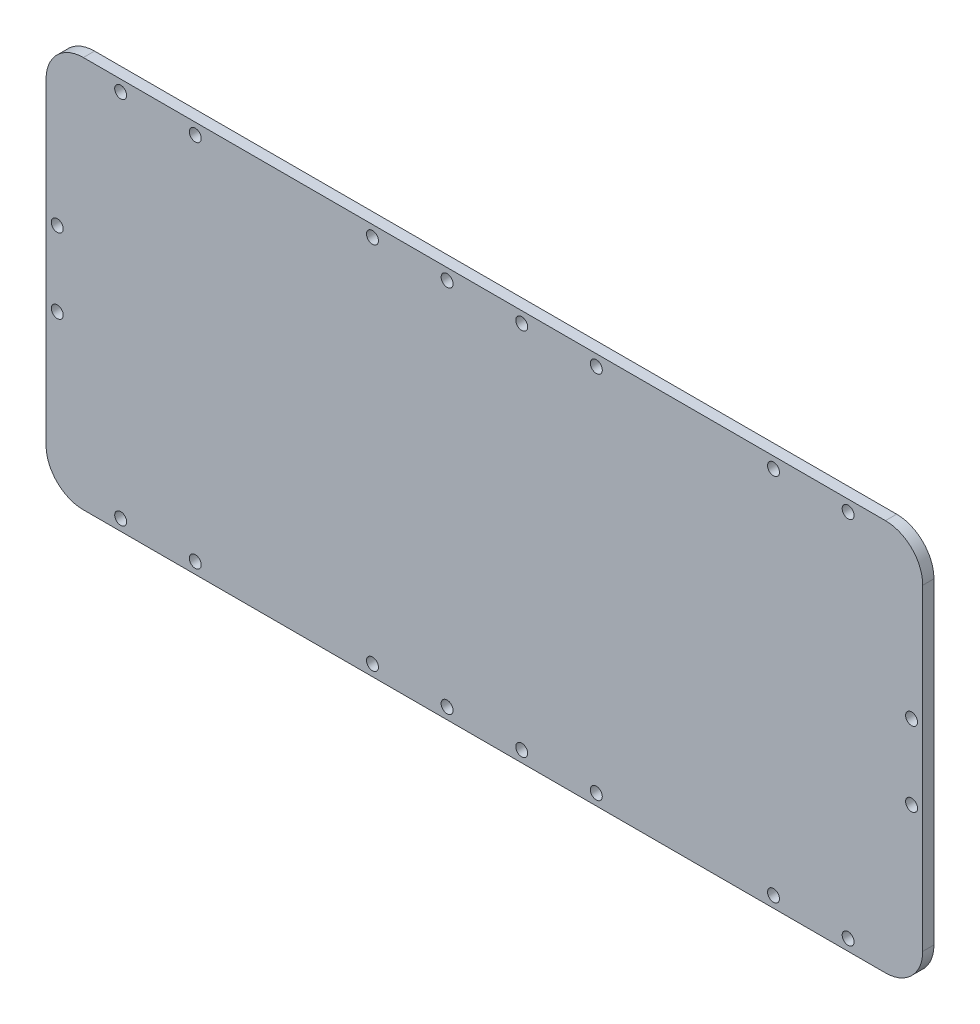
ISO-10303-21;
HEADER;
FILE_DESCRIPTION(('STEP AP214'),'2;1');
FILE_NAME('part.step','',(''),(''),'','','');
FILE_SCHEMA(('AUTOMOTIVE_DESIGN { 1 0 10303 214 1 1 1 1 }'));
ENDSEC;
DATA;
#1=APPLICATION_CONTEXT('core data for automotive mechanical design processes');
#2=APPLICATION_PROTOCOL_DEFINITION('international standard','automotive_design',2000,#1);
#3=PRODUCT_CONTEXT('',#1,'mechanical');
#4=PRODUCT('Part','Part','',(#3));
#5=PRODUCT_RELATED_PRODUCT_CATEGORY('part','',(#4));
#6=PRODUCT_DEFINITION_FORMATION('','',#4);
#7=PRODUCT_DEFINITION_CONTEXT('part definition',#1,'design');
#8=PRODUCT_DEFINITION('design','',#6,#7);
#9=PRODUCT_DEFINITION_SHAPE('','',#8);
#10=(LENGTH_UNIT() NAMED_UNIT(*) SI_UNIT(.MILLI.,.METRE.));
#11=(NAMED_UNIT(*) PLANE_ANGLE_UNIT() SI_UNIT($,.RADIAN.));
#12=(NAMED_UNIT(*) SI_UNIT($,.STERADIAN.) SOLID_ANGLE_UNIT());
#13=UNCERTAINTY_MEASURE_WITH_UNIT(LENGTH_MEASURE(1.E-05),#10,'distance_accuracy_value','');
#14=(GEOMETRIC_REPRESENTATION_CONTEXT(3) GLOBAL_UNCERTAINTY_ASSIGNED_CONTEXT((#13)) GLOBAL_UNIT_ASSIGNED_CONTEXT((#10,
#11,#12)) REPRESENTATION_CONTEXT('',''));
#15=CARTESIAN_POINT('',(0.,0.,0.));
#16=DIRECTION('',(0.,0.,1.));
#17=DIRECTION('',(1.,0.,0.));
#18=AXIS2_PLACEMENT_3D('',#15,#16,#17);
#19=CARTESIAN_POINT('',(0.,0.,3.));
#20=DIRECTION('',(0.,1.,0.));
#21=DIRECTION('',(0.,0.,1.));
#22=AXIS2_PLACEMENT_3D('',#19,#20,#21);
#23=PLANE('',#22);
#24=DIRECTION('',(1.,0.,0.));
#25=VECTOR('',#24,1.);
#26=CARTESIAN_POINT('',(0.,0.,3.));
#27=LINE('',#26,#25);
#28=CARTESIAN_POINT('',(27.,0.,3.));
#29=VERTEX_POINT('',#28);
#30=CARTESIAN_POINT('',(242.,0.,3.));
#31=VERTEX_POINT('',#30);
#32=EDGE_CURVE('E149',#29,#31,#27,.T.);
#33=ORIENTED_EDGE('',*,*,#32,.F.);
#34=DIRECTION('',(0.,0.,1.));
#35=VECTOR('',#34,1.);
#36=CARTESIAN_POINT('',(27.,0.,3.));
#37=LINE('',#36,#35);
#38=CARTESIAN_POINT('',(27.,0.,0.));
#39=VERTEX_POINT('',#38);
#40=EDGE_CURVE('E124',#29,#39,#37,.F.);
#41=ORIENTED_EDGE('',*,*,#40,.T.);
#42=DIRECTION('',(1.,0.,0.));
#43=VECTOR('',#42,1.);
#44=CARTESIAN_POINT('',(0.,0.,0.));
#45=LINE('',#44,#43);
#46=CARTESIAN_POINT('',(242.,0.,0.));
#47=VERTEX_POINT('',#46);
#48=EDGE_CURVE('E156',#39,#47,#45,.T.);
#49=ORIENTED_EDGE('',*,*,#48,.T.);
#50=DIRECTION('',(0.,0.,1.));
#51=VECTOR('',#50,1.);
#52=CARTESIAN_POINT('',(242.,0.,3.));
#53=LINE('',#52,#51);
#54=EDGE_CURVE('E128',#47,#31,#53,.T.);
#55=ORIENTED_EDGE('',*,*,#54,.T.);
#56=EDGE_LOOP('',(#33,#41,#49,#55));
#57=FACE_BOUND('',#56,.T.);
#58=ADVANCED_FACE('F34',(#57),#23,.F.);
#59=CARTESIAN_POINT('',(0.,105.,3.));
#60=DIRECTION('',(0.,-1.,0.));
#61=DIRECTION('',(0.,0.,-1.));
#62=AXIS2_PLACEMENT_3D('',#59,#60,#61);
#63=PLANE('',#62);
#64=DIRECTION('',(-1.,0.,0.));
#65=VECTOR('',#64,1.);
#66=CARTESIAN_POINT('',(0.,105.,3.));
#67=LINE('',#66,#65);
#68=CARTESIAN_POINT('',(242.,105.,3.));
#69=VERTEX_POINT('',#68);
#70=CARTESIAN_POINT('',(27.,105.,3.));
#71=VERTEX_POINT('',#70);
#72=EDGE_CURVE('E141',#69,#71,#67,.T.);
#73=ORIENTED_EDGE('',*,*,#72,.F.);
#74=DIRECTION('',(0.,0.,1.));
#75=VECTOR('',#74,1.);
#76=CARTESIAN_POINT('',(242.,105.,3.));
#77=LINE('',#76,#75);
#78=CARTESIAN_POINT('',(242.,105.,0.));
#79=VERTEX_POINT('',#78);
#80=EDGE_CURVE('E11',#69,#79,#77,.F.);
#81=ORIENTED_EDGE('',*,*,#80,.T.);
#82=DIRECTION('',(-1.,0.,0.));
#83=VECTOR('',#82,1.);
#84=CARTESIAN_POINT('',(0.,105.,0.));
#85=LINE('',#84,#83);
#86=CARTESIAN_POINT('',(27.,105.,0.));
#87=VERTEX_POINT('',#86);
#88=EDGE_CURVE('E143',#79,#87,#85,.T.);
#89=ORIENTED_EDGE('',*,*,#88,.T.);
#90=DIRECTION('',(0.,0.,1.));
#91=VECTOR('',#90,1.);
#92=CARTESIAN_POINT('',(27.,105.,3.));
#93=LINE('',#92,#91);
#94=EDGE_CURVE('E42',#87,#71,#93,.T.);
#95=ORIENTED_EDGE('',*,*,#94,.T.);
#96=EDGE_LOOP('',(#73,#81,#89,#95));
#97=FACE_BOUND('',#96,.T.);
#98=ADVANCED_FACE('F140',(#97),#63,.F.);
#99=CARTESIAN_POINT('',(0.,0.,3.));
#100=DIRECTION('',(0.,0.,-1.));
#101=DIRECTION('',(-1.,0.,0.));
#102=AXIS2_PLACEMENT_3D('',#99,#100,#101);
#103=PLANE('',#102);
#104=CARTESIAN_POINT('',(249.,62.5,3.));
#105=DIRECTION('',(0.,0.,1.));
#106=DIRECTION('',(-1.,0.,0.));
#107=AXIS2_PLACEMENT_3D('',#104,#105,#106);
#108=CIRCLE('',#107,1.60000000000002);
#109=CARTESIAN_POINT('',(247.4,62.5,3.));
#110=VERTEX_POINT('',#109);
#111=EDGE_CURVE('E310',#110,#110,#108,.T.);
#112=ORIENTED_EDGE('',*,*,#111,.F.);
#113=EDGE_LOOP('',(#112));
#114=FACE_BOUND('',#113,.T.);
#115=CARTESIAN_POINT('',(249.,42.5,3.));
#116=DIRECTION('',(0.,0.,1.));
#117=DIRECTION('',(-1.,0.,0.));
#118=AXIS2_PLACEMENT_3D('',#115,#116,#117);
#119=CIRCLE('',#118,1.59999999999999);
#120=CARTESIAN_POINT('',(247.4,42.5,3.));
#121=VERTEX_POINT('',#120);
#122=EDGE_CURVE('E305',#121,#121,#119,.T.);
#123=ORIENTED_EDGE('',*,*,#122,.F.);
#124=EDGE_LOOP('',(#123));
#125=FACE_BOUND('',#124,.T.);
#126=CARTESIAN_POINT('',(20.,42.5,3.));
#127=DIRECTION('',(0.,0.,1.));
#128=DIRECTION('',(1.,0.,0.));
#129=AXIS2_PLACEMENT_3D('',#126,#127,#128);
#130=CIRCLE('',#129,1.6);
#131=CARTESIAN_POINT('',(21.6,42.5,3.));
#132=VERTEX_POINT('',#131);
#133=EDGE_CURVE('E303',#132,#132,#130,.T.);
#134=ORIENTED_EDGE('',*,*,#133,.F.);
#135=EDGE_LOOP('',(#134));
#136=FACE_BOUND('',#135,.T.);
#137=CARTESIAN_POINT('',(20.,62.5,3.));
#138=DIRECTION('',(0.,0.,1.));
#139=DIRECTION('',(1.,0.,0.));
#140=AXIS2_PLACEMENT_3D('',#137,#138,#139);
#141=CIRCLE('',#140,1.6);
#142=CARTESIAN_POINT('',(21.6,62.5,3.));
#143=VERTEX_POINT('',#142);
#144=EDGE_CURVE('E165',#143,#143,#141,.T.);
#145=ORIENTED_EDGE('',*,*,#144,.F.);
#146=EDGE_LOOP('',(#145));
#147=FACE_BOUND('',#146,.T.);
#148=CARTESIAN_POINT('',(57.0000000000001,3.,3.));
#149=DIRECTION('',(0.,0.,1.));
#150=DIRECTION('',(1.,0.,0.));
#151=AXIS2_PLACEMENT_3D('',#148,#149,#150);
#152=CIRCLE('',#151,1.59999999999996);
#153=CARTESIAN_POINT('',(58.6000000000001,3.,3.));
#154=VERTEX_POINT('',#153);
#155=EDGE_CURVE('E364',#154,#154,#152,.T.);
#156=ORIENTED_EDGE('',*,*,#155,.F.);
#157=EDGE_LOOP('',(#156));
#158=FACE_BOUND('',#157,.T.);
#159=CARTESIAN_POINT('',(104.5,3.,3.));
#160=DIRECTION('',(0.,0.,1.));
#161=DIRECTION('',(1.,0.,0.));
#162=AXIS2_PLACEMENT_3D('',#159,#160,#161);
#163=CIRCLE('',#162,1.60000000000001);
#164=CARTESIAN_POINT('',(106.1,3.,3.));
#165=VERTEX_POINT('',#164);
#166=EDGE_CURVE('E370',#165,#165,#163,.T.);
#167=ORIENTED_EDGE('',*,*,#166,.F.);
#168=EDGE_LOOP('',(#167));
#169=FACE_BOUND('',#168,.T.);
#170=CARTESIAN_POINT('',(124.5,3.,3.));
#171=DIRECTION('',(0.,0.,1.));
#172=DIRECTION('',(1.,0.,0.));
#173=AXIS2_PLACEMENT_3D('',#170,#171,#172);
#174=CIRCLE('',#173,1.59999999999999);
#175=CARTESIAN_POINT('',(126.1,3.,3.));
#176=VERTEX_POINT('',#175);
#177=EDGE_CURVE('E376',#176,#176,#174,.T.);
#178=ORIENTED_EDGE('',*,*,#177,.F.);
#179=EDGE_LOOP('',(#178));
#180=FACE_BOUND('',#179,.T.);
#181=CARTESIAN_POINT('',(144.5,3.,3.));
#182=DIRECTION('',(0.,0.,1.));
#183=DIRECTION('',(-1.,0.,0.));
#184=AXIS2_PLACEMENT_3D('',#181,#182,#183);
#185=CIRCLE('',#184,1.59999999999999);
#186=CARTESIAN_POINT('',(142.9,3.,3.));
#187=VERTEX_POINT('',#186);
#188=EDGE_CURVE('E382',#187,#187,#185,.T.);
#189=ORIENTED_EDGE('',*,*,#188,.F.);
#190=EDGE_LOOP('',(#189));
#191=FACE_BOUND('',#190,.T.);
#192=CARTESIAN_POINT('',(164.5,3.,3.));
#193=DIRECTION('',(0.,0.,1.));
#194=DIRECTION('',(-1.,0.,0.));
#195=AXIS2_PLACEMENT_3D('',#192,#193,#194);
#196=CIRCLE('',#195,1.60000000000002);
#197=CARTESIAN_POINT('',(162.9,3.,3.));
#198=VERTEX_POINT('',#197);
#199=EDGE_CURVE('E388',#198,#198,#196,.T.);
#200=ORIENTED_EDGE('',*,*,#199,.F.);
#201=EDGE_LOOP('',(#200));
#202=FACE_BOUND('',#201,.T.);
#203=CARTESIAN_POINT('',(212.,3.,3.));
#204=DIRECTION('',(0.,0.,1.));
#205=DIRECTION('',(-1.,0.,0.));
#206=AXIS2_PLACEMENT_3D('',#203,#204,#205);
#207=CIRCLE('',#206,1.60000000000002);
#208=CARTESIAN_POINT('',(210.4,3.,3.));
#209=VERTEX_POINT('',#208);
#210=EDGE_CURVE('E394',#209,#209,#207,.T.);
#211=ORIENTED_EDGE('',*,*,#210,.F.);
#212=EDGE_LOOP('',(#211));
#213=FACE_BOUND('',#212,.T.);
#214=CARTESIAN_POINT('',(232.,3.,3.));
#215=DIRECTION('',(0.,0.,1.));
#216=DIRECTION('',(-1.,0.,0.));
#217=AXIS2_PLACEMENT_3D('',#214,#215,#216);
#218=CIRCLE('',#217,1.59999999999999);
#219=CARTESIAN_POINT('',(230.4,3.,3.));
#220=VERTEX_POINT('',#219);
#221=EDGE_CURVE('E400',#220,#220,#218,.T.);
#222=ORIENTED_EDGE('',*,*,#221,.F.);
#223=EDGE_LOOP('',(#222));
#224=FACE_BOUND('',#223,.T.);
#225=CARTESIAN_POINT('',(232.,102.,3.));
#226=DIRECTION('',(0.,0.,1.));
#227=DIRECTION('',(1.,0.,0.));
#228=AXIS2_PLACEMENT_3D('',#225,#226,#227);
#229=CIRCLE('',#228,1.59999999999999);
#230=CARTESIAN_POINT('',(233.6,102.,3.));
#231=VERTEX_POINT('',#230);
#232=EDGE_CURVE('E321',#231,#231,#229,.T.);
#233=ORIENTED_EDGE('',*,*,#232,.F.);
#234=EDGE_LOOP('',(#233));
#235=FACE_BOUND('',#234,.T.);
#236=CARTESIAN_POINT('',(212.,102.,3.));
#237=DIRECTION('',(0.,0.,1.));
#238=DIRECTION('',(1.,0.,0.));
#239=AXIS2_PLACEMENT_3D('',#236,#237,#238);
#240=CIRCLE('',#239,1.60000000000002);
#241=CARTESIAN_POINT('',(213.6,102.,3.));
#242=VERTEX_POINT('',#241);
#243=EDGE_CURVE('E322',#242,#242,#240,.T.);
#244=ORIENTED_EDGE('',*,*,#243,.F.);
#245=EDGE_LOOP('',(#244));
#246=FACE_BOUND('',#245,.T.);
#247=CARTESIAN_POINT('',(164.5,102.,3.));
#248=DIRECTION('',(0.,0.,1.));
#249=DIRECTION('',(1.,0.,0.));
#250=AXIS2_PLACEMENT_3D('',#247,#248,#249);
#251=CIRCLE('',#250,1.60000000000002);
#252=CARTESIAN_POINT('',(166.1,102.,3.));
#253=VERTEX_POINT('',#252);
#254=EDGE_CURVE('E328',#253,#253,#251,.T.);
#255=ORIENTED_EDGE('',*,*,#254,.F.);
#256=EDGE_LOOP('',(#255));
#257=FACE_BOUND('',#256,.T.);
#258=CARTESIAN_POINT('',(144.5,102.,3.));
#259=DIRECTION('',(0.,0.,1.));
#260=DIRECTION('',(1.,0.,0.));
#261=AXIS2_PLACEMENT_3D('',#258,#259,#260);
#262=CIRCLE('',#261,1.59999999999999);
#263=CARTESIAN_POINT('',(146.1,102.,3.));
#264=VERTEX_POINT('',#263);
#265=EDGE_CURVE('E334',#264,#264,#262,.T.);
#266=ORIENTED_EDGE('',*,*,#265,.F.);
#267=EDGE_LOOP('',(#266));
#268=FACE_BOUND('',#267,.T.);
#269=CARTESIAN_POINT('',(124.5,102.,3.));
#270=DIRECTION('',(0.,0.,1.));
#271=DIRECTION('',(-1.,0.,0.));
#272=AXIS2_PLACEMENT_3D('',#269,#270,#271);
#273=CIRCLE('',#272,1.59999999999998);
#274=CARTESIAN_POINT('',(122.9,102.,3.));
#275=VERTEX_POINT('',#274);
#276=EDGE_CURVE('E340',#275,#275,#273,.T.);
#277=ORIENTED_EDGE('',*,*,#276,.F.);
#278=EDGE_LOOP('',(#277));
#279=FACE_BOUND('',#278,.T.);
#280=CARTESIAN_POINT('',(104.5,102.,3.));
#281=DIRECTION('',(0.,0.,1.));
#282=DIRECTION('',(-1.,0.,0.));
#283=AXIS2_PLACEMENT_3D('',#280,#281,#282);
#284=CIRCLE('',#283,1.60000000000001);
#285=CARTESIAN_POINT('',(102.9,102.,3.));
#286=VERTEX_POINT('',#285);
#287=EDGE_CURVE('E346',#286,#286,#284,.T.);
#288=ORIENTED_EDGE('',*,*,#287,.F.);
#289=EDGE_LOOP('',(#288));
#290=FACE_BOUND('',#289,.T.);
#291=CARTESIAN_POINT('',(57.,102.,3.));
#292=DIRECTION('',(0.,0.,1.));
#293=DIRECTION('',(-1.,0.,0.));
#294=AXIS2_PLACEMENT_3D('',#291,#292,#293);
#295=CIRCLE('',#294,1.59999999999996);
#296=CARTESIAN_POINT('',(55.4,102.,3.));
#297=VERTEX_POINT('',#296);
#298=EDGE_CURVE('E352',#297,#297,#295,.T.);
#299=ORIENTED_EDGE('',*,*,#298,.F.);
#300=EDGE_LOOP('',(#299));
#301=FACE_BOUND('',#300,.T.);
#302=CARTESIAN_POINT('',(37.,102.,3.));
#303=DIRECTION('',(0.,0.,1.));
#304=DIRECTION('',(-1.,0.,0.));
#305=AXIS2_PLACEMENT_3D('',#302,#303,#304);
#306=CIRCLE('',#305,1.59999999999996);
#307=CARTESIAN_POINT('',(35.4,102.,3.));
#308=VERTEX_POINT('',#307);
#309=EDGE_CURVE('E316',#308,#308,#306,.T.);
#310=ORIENTED_EDGE('',*,*,#309,.F.);
#311=EDGE_LOOP('',(#310));
#312=FACE_BOUND('',#311,.T.);
#313=CARTESIAN_POINT('',(37.0000000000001,3.,3.));
#314=DIRECTION('',(0.,0.,1.));
#315=DIRECTION('',(1.,0.,0.));
#316=AXIS2_PLACEMENT_3D('',#313,#314,#315);
#317=CIRCLE('',#316,1.59999999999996);
#318=CARTESIAN_POINT('',(38.6000000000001,3.,3.));
#319=VERTEX_POINT('',#318);
#320=EDGE_CURVE('E363',#319,#319,#317,.T.);
#321=ORIENTED_EDGE('',*,*,#320,.F.);
#322=EDGE_LOOP('',(#321));
#323=FACE_BOUND('',#322,.T.);
#324=DIRECTION('',(0.,1.,0.));
#325=VECTOR('',#324,1.);
#326=CARTESIAN_POINT('',(17.,105.,3.));
#327=LINE('',#326,#325);
#328=CARTESIAN_POINT('',(17.,9.99999999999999,3.));
#329=VERTEX_POINT('',#328);
#330=CARTESIAN_POINT('',(17.,95.,3.));
#331=VERTEX_POINT('',#330);
#332=EDGE_CURVE('E108',#329,#331,#327,.T.);
#333=ORIENTED_EDGE('',*,*,#332,.F.);
#334=CARTESIAN_POINT('',(27.,9.99999999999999,3.));
#335=DIRECTION('',(0.,0.,-1.));
#336=DIRECTION('',(-1.,0.,0.));
#337=AXIS2_PLACEMENT_3D('',#334,#335,#336);
#338=CIRCLE('',#337,10.);
#339=EDGE_CURVE('E180',#329,#29,#338,.F.);
#340=ORIENTED_EDGE('',*,*,#339,.T.);
#341=ORIENTED_EDGE('',*,*,#32,.T.);
#342=CARTESIAN_POINT('',(242.,10.,3.));
#343=DIRECTION('',(0.,0.,-1.));
#344=DIRECTION('',(-1.,0.,0.));
#345=AXIS2_PLACEMENT_3D('',#342,#343,#344);
#346=CIRCLE('',#345,10.);
#347=CARTESIAN_POINT('',(252.,9.99999999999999,3.));
#348=VERTEX_POINT('',#347);
#349=EDGE_CURVE('E178',#31,#348,#346,.F.);
#350=ORIENTED_EDGE('',*,*,#349,.T.);
#351=DIRECTION('',(0.,-1.,0.));
#352=VECTOR('',#351,1.);
#353=CARTESIAN_POINT('',(252.,105.,3.));
#354=LINE('',#353,#352);
#355=CARTESIAN_POINT('',(252.,95.,3.));
#356=VERTEX_POINT('',#355);
#357=EDGE_CURVE('E173',#356,#348,#354,.T.);
#358=ORIENTED_EDGE('',*,*,#357,.F.);
#359=CARTESIAN_POINT('',(242.,95.,3.));
#360=DIRECTION('',(0.,0.,-1.));
#361=DIRECTION('',(-1.,0.,0.));
#362=AXIS2_PLACEMENT_3D('',#359,#360,#361);
#363=CIRCLE('',#362,10.);
#364=EDGE_CURVE('E148',#356,#69,#363,.F.);
#365=ORIENTED_EDGE('',*,*,#364,.T.);
#366=ORIENTED_EDGE('',*,*,#72,.T.);
#367=CARTESIAN_POINT('',(27.,95.,3.));
#368=DIRECTION('',(0.,0.,-1.));
#369=DIRECTION('',(-1.,0.,0.));
#370=AXIS2_PLACEMENT_3D('',#367,#368,#369);
#371=CIRCLE('',#370,10.);
#372=EDGE_CURVE('E146',#71,#331,#371,.F.);
#373=ORIENTED_EDGE('',*,*,#372,.T.);
#374=EDGE_LOOP('',(#333,#340,#341,#350,#358,#365,#366,#373));
#375=FACE_BOUND('',#374,.T.);
#376=ADVANCED_FACE('F145',(#114,#125,#136,#147,#158,#169,#180,#191,#202,#213,#224,#235,#246,
#257,#268,#279,#290,#301,#312,#323,#375),#103,.F.);
#377=CARTESIAN_POINT('',(0.,0.,0.));
#378=DIRECTION('',(0.,0.,-1.));
#379=DIRECTION('',(-1.,0.,0.));
#380=AXIS2_PLACEMENT_3D('',#377,#378,#379);
#381=PLANE('',#380);
#382=CARTESIAN_POINT('',(249.,62.5,0.));
#383=DIRECTION('',(0.,0.,-1.));
#384=DIRECTION('',(-1.,0.,0.));
#385=AXIS2_PLACEMENT_3D('',#382,#383,#384);
#386=CIRCLE('',#385,1.60000000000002);
#387=CARTESIAN_POINT('',(247.4,62.5,0.));
#388=VERTEX_POINT('',#387);
#389=EDGE_CURVE('E171',#388,#388,#386,.T.);
#390=ORIENTED_EDGE('',*,*,#389,.F.);
#391=EDGE_LOOP('',(#390));
#392=FACE_BOUND('',#391,.T.);
#393=CARTESIAN_POINT('',(249.,42.5,0.));
#394=DIRECTION('',(0.,0.,-1.));
#395=DIRECTION('',(-1.,0.,0.));
#396=AXIS2_PLACEMENT_3D('',#393,#394,#395);
#397=CIRCLE('',#396,1.59999999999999);
#398=CARTESIAN_POINT('',(247.4,42.5,0.));
#399=VERTEX_POINT('',#398);
#400=EDGE_CURVE('E168',#399,#399,#397,.T.);
#401=ORIENTED_EDGE('',*,*,#400,.F.);
#402=EDGE_LOOP('',(#401));
#403=FACE_BOUND('',#402,.T.);
#404=CARTESIAN_POINT('',(20.,42.5,0.));
#405=DIRECTION('',(0.,0.,-1.));
#406=DIRECTION('',(-1.,0.,0.));
#407=AXIS2_PLACEMENT_3D('',#404,#405,#406);
#408=CIRCLE('',#407,1.6);
#409=CARTESIAN_POINT('',(18.4,42.5,0.));
#410=VERTEX_POINT('',#409);
#411=EDGE_CURVE('E164',#410,#410,#408,.T.);
#412=ORIENTED_EDGE('',*,*,#411,.F.);
#413=EDGE_LOOP('',(#412));
#414=FACE_BOUND('',#413,.T.);
#415=CARTESIAN_POINT('',(20.,62.5,0.));
#416=DIRECTION('',(0.,0.,-1.));
#417=DIRECTION('',(-1.,0.,0.));
#418=AXIS2_PLACEMENT_3D('',#415,#416,#417);
#419=CIRCLE('',#418,1.6);
#420=CARTESIAN_POINT('',(18.4,62.5,0.));
#421=VERTEX_POINT('',#420);
#422=EDGE_CURVE('E161',#421,#421,#419,.T.);
#423=ORIENTED_EDGE('',*,*,#422,.F.);
#424=EDGE_LOOP('',(#423));
#425=FACE_BOUND('',#424,.T.);
#426=ORIENTED_EDGE('',*,*,#48,.F.);
#427=CARTESIAN_POINT('',(27.,9.99999999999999,0.));
#428=DIRECTION('',(0.,0.,-1.));
#429=DIRECTION('',(-1.,0.,0.));
#430=AXIS2_PLACEMENT_3D('',#427,#428,#429);
#431=CIRCLE('',#430,10.);
#432=CARTESIAN_POINT('',(17.,9.99999999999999,0.));
#433=VERTEX_POINT('',#432);
#434=EDGE_CURVE('E119',#39,#433,#431,.T.);
#435=ORIENTED_EDGE('',*,*,#434,.T.);
#436=DIRECTION('',(0.,-1.,0.));
#437=VECTOR('',#436,1.);
#438=CARTESIAN_POINT('',(17.,0.,0.));
#439=LINE('',#438,#437);
#440=CARTESIAN_POINT('',(17.,95.,0.));
#441=VERTEX_POINT('',#440);
#442=EDGE_CURVE('E105',#441,#433,#439,.T.);
#443=ORIENTED_EDGE('',*,*,#442,.F.);
#444=CARTESIAN_POINT('',(27.,95.,0.));
#445=DIRECTION('',(0.,0.,-1.));
#446=DIRECTION('',(-1.,0.,0.));
#447=AXIS2_PLACEMENT_3D('',#444,#445,#446);
#448=CIRCLE('',#447,10.);
#449=EDGE_CURVE('E116',#441,#87,#448,.T.);
#450=ORIENTED_EDGE('',*,*,#449,.T.);
#451=ORIENTED_EDGE('',*,*,#88,.F.);
#452=CARTESIAN_POINT('',(242.,95.,0.));
#453=DIRECTION('',(0.,0.,-1.));
#454=DIRECTION('',(-1.,0.,0.));
#455=AXIS2_PLACEMENT_3D('',#452,#453,#454);
#456=CIRCLE('',#455,10.);
#457=CARTESIAN_POINT('',(252.,95.,0.));
#458=VERTEX_POINT('',#457);
#459=EDGE_CURVE('E49',#79,#458,#456,.T.);
#460=ORIENTED_EDGE('',*,*,#459,.T.);
#461=DIRECTION('',(0.,1.,0.));
#462=VECTOR('',#461,1.);
#463=CARTESIAN_POINT('',(252.,0.,0.));
#464=LINE('',#463,#462);
#465=CARTESIAN_POINT('',(252.,10.,0.));
#466=VERTEX_POINT('',#465);
#467=EDGE_CURVE('E120',#466,#458,#464,.T.);
#468=ORIENTED_EDGE('',*,*,#467,.F.);
#469=CARTESIAN_POINT('',(242.,10.,0.));
#470=DIRECTION('',(0.,0.,-1.));
#471=DIRECTION('',(-1.,0.,0.));
#472=AXIS2_PLACEMENT_3D('',#469,#470,#471);
#473=CIRCLE('',#472,10.);
#474=EDGE_CURVE('E126',#466,#47,#473,.T.);
#475=ORIENTED_EDGE('',*,*,#474,.T.);
#476=EDGE_LOOP('',(#426,#435,#443,#450,#451,#460,#468,#475));
#477=FACE_BOUND('',#476,.T.);
#478=CARTESIAN_POINT('',(57.0000000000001,3.,0.));
#479=DIRECTION('',(0.,0.,1.));
#480=DIRECTION('',(1.,0.,0.));
#481=AXIS2_PLACEMENT_3D('',#478,#479,#480);
#482=CIRCLE('',#481,1.59999999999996);
#483=CARTESIAN_POINT('',(58.6000000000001,3.,0.));
#484=VERTEX_POINT('',#483);
#485=EDGE_CURVE('E360',#484,#484,#482,.T.);
#486=ORIENTED_EDGE('',*,*,#485,.T.);
#487=EDGE_LOOP('',(#486));
#488=FACE_BOUND('',#487,.T.);
#489=CARTESIAN_POINT('',(104.5,3.,0.));
#490=DIRECTION('',(0.,0.,1.));
#491=DIRECTION('',(1.,0.,0.));
#492=AXIS2_PLACEMENT_3D('',#489,#490,#491);
#493=CIRCLE('',#492,1.60000000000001);
#494=CARTESIAN_POINT('',(106.1,3.,0.));
#495=VERTEX_POINT('',#494);
#496=EDGE_CURVE('E367',#495,#495,#493,.T.);
#497=ORIENTED_EDGE('',*,*,#496,.T.);
#498=EDGE_LOOP('',(#497));
#499=FACE_BOUND('',#498,.T.);
#500=CARTESIAN_POINT('',(124.5,3.,0.));
#501=DIRECTION('',(0.,0.,1.));
#502=DIRECTION('',(1.,0.,0.));
#503=AXIS2_PLACEMENT_3D('',#500,#501,#502);
#504=CIRCLE('',#503,1.59999999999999);
#505=CARTESIAN_POINT('',(126.1,3.,0.));
#506=VERTEX_POINT('',#505);
#507=EDGE_CURVE('E373',#506,#506,#504,.T.);
#508=ORIENTED_EDGE('',*,*,#507,.T.);
#509=EDGE_LOOP('',(#508));
#510=FACE_BOUND('',#509,.T.);
#511=CARTESIAN_POINT('',(144.5,3.,0.));
#512=DIRECTION('',(0.,0.,1.));
#513=DIRECTION('',(-1.,0.,0.));
#514=AXIS2_PLACEMENT_3D('',#511,#512,#513);
#515=CIRCLE('',#514,1.59999999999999);
#516=CARTESIAN_POINT('',(142.9,3.,0.));
#517=VERTEX_POINT('',#516);
#518=EDGE_CURVE('E379',#517,#517,#515,.T.);
#519=ORIENTED_EDGE('',*,*,#518,.T.);
#520=EDGE_LOOP('',(#519));
#521=FACE_BOUND('',#520,.T.);
#522=CARTESIAN_POINT('',(164.5,3.,0.));
#523=DIRECTION('',(0.,0.,1.));
#524=DIRECTION('',(-1.,0.,0.));
#525=AXIS2_PLACEMENT_3D('',#522,#523,#524);
#526=CIRCLE('',#525,1.60000000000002);
#527=CARTESIAN_POINT('',(162.9,3.,0.));
#528=VERTEX_POINT('',#527);
#529=EDGE_CURVE('E385',#528,#528,#526,.T.);
#530=ORIENTED_EDGE('',*,*,#529,.T.);
#531=EDGE_LOOP('',(#530));
#532=FACE_BOUND('',#531,.T.);
#533=CARTESIAN_POINT('',(212.,3.,0.));
#534=DIRECTION('',(0.,0.,1.));
#535=DIRECTION('',(-1.,0.,0.));
#536=AXIS2_PLACEMENT_3D('',#533,#534,#535);
#537=CIRCLE('',#536,1.60000000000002);
#538=CARTESIAN_POINT('',(210.4,3.,0.));
#539=VERTEX_POINT('',#538);
#540=EDGE_CURVE('E391',#539,#539,#537,.T.);
#541=ORIENTED_EDGE('',*,*,#540,.T.);
#542=EDGE_LOOP('',(#541));
#543=FACE_BOUND('',#542,.T.);
#544=CARTESIAN_POINT('',(232.,3.,0.));
#545=DIRECTION('',(0.,0.,1.));
#546=DIRECTION('',(-1.,0.,0.));
#547=AXIS2_PLACEMENT_3D('',#544,#545,#546);
#548=CIRCLE('',#547,1.59999999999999);
#549=CARTESIAN_POINT('',(230.4,3.,0.));
#550=VERTEX_POINT('',#549);
#551=EDGE_CURVE('E397',#550,#550,#548,.T.);
#552=ORIENTED_EDGE('',*,*,#551,.T.);
#553=EDGE_LOOP('',(#552));
#554=FACE_BOUND('',#553,.T.);
#555=CARTESIAN_POINT('',(232.,102.,0.));
#556=DIRECTION('',(0.,0.,1.));
#557=DIRECTION('',(1.,0.,0.));
#558=AXIS2_PLACEMENT_3D('',#555,#556,#557);
#559=CIRCLE('',#558,1.59999999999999);
#560=CARTESIAN_POINT('',(233.6,102.,0.));
#561=VERTEX_POINT('',#560);
#562=EDGE_CURVE('E403',#561,#561,#559,.T.);
#563=ORIENTED_EDGE('',*,*,#562,.T.);
#564=EDGE_LOOP('',(#563));
#565=FACE_BOUND('',#564,.T.);
#566=CARTESIAN_POINT('',(212.,102.,0.));
#567=DIRECTION('',(0.,0.,1.));
#568=DIRECTION('',(1.,0.,0.));
#569=AXIS2_PLACEMENT_3D('',#566,#567,#568);
#570=CIRCLE('',#569,1.60000000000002);
#571=CARTESIAN_POINT('',(213.6,102.,0.));
#572=VERTEX_POINT('',#571);
#573=EDGE_CURVE('E318',#572,#572,#570,.T.);
#574=ORIENTED_EDGE('',*,*,#573,.T.);
#575=EDGE_LOOP('',(#574));
#576=FACE_BOUND('',#575,.T.);
#577=CARTESIAN_POINT('',(164.5,102.,0.));
#578=DIRECTION('',(0.,0.,1.));
#579=DIRECTION('',(1.,0.,0.));
#580=AXIS2_PLACEMENT_3D('',#577,#578,#579);
#581=CIRCLE('',#580,1.60000000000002);
#582=CARTESIAN_POINT('',(166.1,102.,0.));
#583=VERTEX_POINT('',#582);
#584=EDGE_CURVE('E325',#583,#583,#581,.T.);
#585=ORIENTED_EDGE('',*,*,#584,.T.);
#586=EDGE_LOOP('',(#585));
#587=FACE_BOUND('',#586,.T.);
#588=CARTESIAN_POINT('',(144.5,102.,0.));
#589=DIRECTION('',(0.,0.,1.));
#590=DIRECTION('',(1.,0.,0.));
#591=AXIS2_PLACEMENT_3D('',#588,#589,#590);
#592=CIRCLE('',#591,1.59999999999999);
#593=CARTESIAN_POINT('',(146.1,102.,0.));
#594=VERTEX_POINT('',#593);
#595=EDGE_CURVE('E331',#594,#594,#592,.T.);
#596=ORIENTED_EDGE('',*,*,#595,.T.);
#597=EDGE_LOOP('',(#596));
#598=FACE_BOUND('',#597,.T.);
#599=CARTESIAN_POINT('',(124.5,102.,0.));
#600=DIRECTION('',(0.,0.,1.));
#601=DIRECTION('',(-1.,0.,0.));
#602=AXIS2_PLACEMENT_3D('',#599,#600,#601);
#603=CIRCLE('',#602,1.59999999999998);
#604=CARTESIAN_POINT('',(122.9,102.,0.));
#605=VERTEX_POINT('',#604);
#606=EDGE_CURVE('E337',#605,#605,#603,.T.);
#607=ORIENTED_EDGE('',*,*,#606,.T.);
#608=EDGE_LOOP('',(#607));
#609=FACE_BOUND('',#608,.T.);
#610=CARTESIAN_POINT('',(104.5,102.,0.));
#611=DIRECTION('',(0.,0.,1.));
#612=DIRECTION('',(-1.,0.,0.));
#613=AXIS2_PLACEMENT_3D('',#610,#611,#612);
#614=CIRCLE('',#613,1.60000000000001);
#615=CARTESIAN_POINT('',(102.9,102.,0.));
#616=VERTEX_POINT('',#615);
#617=EDGE_CURVE('E343',#616,#616,#614,.T.);
#618=ORIENTED_EDGE('',*,*,#617,.T.);
#619=EDGE_LOOP('',(#618));
#620=FACE_BOUND('',#619,.T.);
#621=CARTESIAN_POINT('',(57.,102.,0.));
#622=DIRECTION('',(0.,0.,1.));
#623=DIRECTION('',(-1.,0.,0.));
#624=AXIS2_PLACEMENT_3D('',#621,#622,#623);
#625=CIRCLE('',#624,1.59999999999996);
#626=CARTESIAN_POINT('',(55.4,102.,0.));
#627=VERTEX_POINT('',#626);
#628=EDGE_CURVE('E349',#627,#627,#625,.T.);
#629=ORIENTED_EDGE('',*,*,#628,.T.);
#630=EDGE_LOOP('',(#629));
#631=FACE_BOUND('',#630,.T.);
#632=CARTESIAN_POINT('',(37.,102.,0.));
#633=DIRECTION('',(0.,0.,1.));
#634=DIRECTION('',(-1.,0.,0.));
#635=AXIS2_PLACEMENT_3D('',#632,#633,#634);
#636=CIRCLE('',#635,1.59999999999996);
#637=CARTESIAN_POINT('',(35.4,102.,0.));
#638=VERTEX_POINT('',#637);
#639=EDGE_CURVE('E355',#638,#638,#636,.T.);
#640=ORIENTED_EDGE('',*,*,#639,.T.);
#641=EDGE_LOOP('',(#640));
#642=FACE_BOUND('',#641,.T.);
#643=CARTESIAN_POINT('',(37.0000000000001,3.,0.));
#644=DIRECTION('',(0.,0.,1.));
#645=DIRECTION('',(1.,0.,0.));
#646=AXIS2_PLACEMENT_3D('',#643,#644,#645);
#647=CIRCLE('',#646,1.59999999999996);
#648=CARTESIAN_POINT('',(38.6000000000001,3.,0.));
#649=VERTEX_POINT('',#648);
#650=EDGE_CURVE('E159',#649,#649,#647,.T.);
#651=ORIENTED_EDGE('',*,*,#650,.T.);
#652=EDGE_LOOP('',(#651));
#653=FACE_BOUND('',#652,.T.);
#654=ADVANCED_FACE('F114',(#392,#403,#414,#425,#477,#488,#499,#510,#521,#532,#543,#554,#565,
#576,#587,#598,#609,#620,#631,#642,#653),#381,.T.);
#655=CARTESIAN_POINT('',(37.0000000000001,3.,0.));
#656=DIRECTION('',(0.,0.,1.));
#657=DIRECTION('',(1.,0.,0.));
#658=AXIS2_PLACEMENT_3D('',#655,#656,#657);
#659=CYLINDRICAL_SURFACE('',#658,1.59999999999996);
#660=ORIENTED_EDGE('',*,*,#650,.F.);
#661=EDGE_LOOP('',(#660));
#662=FACE_BOUND('',#661,.T.);
#663=ORIENTED_EDGE('',*,*,#320,.T.);
#664=EDGE_LOOP('',(#663));
#665=FACE_BOUND('',#664,.T.);
#666=ADVANCED_FACE('F210',(#662,#665),#659,.F.);
#667=CARTESIAN_POINT('',(37.,102.,0.));
#668=DIRECTION('',(0.,0.,1.));
#669=DIRECTION('',(1.,0.,0.));
#670=AXIS2_PLACEMENT_3D('',#667,#668,#669);
#671=CYLINDRICAL_SURFACE('',#670,1.59999999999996);
#672=ORIENTED_EDGE('',*,*,#639,.F.);
#673=EDGE_LOOP('',(#672));
#674=FACE_BOUND('',#673,.T.);
#675=ORIENTED_EDGE('',*,*,#309,.T.);
#676=EDGE_LOOP('',(#675));
#677=FACE_BOUND('',#676,.T.);
#678=ADVANCED_FACE('F217',(#674,#677),#671,.F.);
#679=CARTESIAN_POINT('',(57.,102.,0.));
#680=DIRECTION('',(0.,0.,1.));
#681=DIRECTION('',(1.,0.,0.));
#682=AXIS2_PLACEMENT_3D('',#679,#680,#681);
#683=CYLINDRICAL_SURFACE('',#682,1.59999999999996);
#684=ORIENTED_EDGE('',*,*,#628,.F.);
#685=EDGE_LOOP('',(#684));
#686=FACE_BOUND('',#685,.T.);
#687=ORIENTED_EDGE('',*,*,#298,.T.);
#688=EDGE_LOOP('',(#687));
#689=FACE_BOUND('',#688,.T.);
#690=ADVANCED_FACE('F255',(#686,#689),#683,.F.);
#691=CARTESIAN_POINT('',(104.5,102.,0.));
#692=DIRECTION('',(0.,0.,1.));
#693=DIRECTION('',(1.,0.,0.));
#694=AXIS2_PLACEMENT_3D('',#691,#692,#693);
#695=CYLINDRICAL_SURFACE('',#694,1.60000000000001);
#696=ORIENTED_EDGE('',*,*,#617,.F.);
#697=EDGE_LOOP('',(#696));
#698=FACE_BOUND('',#697,.T.);
#699=ORIENTED_EDGE('',*,*,#287,.T.);
#700=EDGE_LOOP('',(#699));
#701=FACE_BOUND('',#700,.T.);
#702=ADVANCED_FACE('F259',(#698,#701),#695,.F.);
#703=CARTESIAN_POINT('',(124.5,102.,0.));
#704=DIRECTION('',(0.,0.,1.));
#705=DIRECTION('',(1.,0.,0.));
#706=AXIS2_PLACEMENT_3D('',#703,#704,#705);
#707=CYLINDRICAL_SURFACE('',#706,1.59999999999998);
#708=ORIENTED_EDGE('',*,*,#606,.F.);
#709=EDGE_LOOP('',(#708));
#710=FACE_BOUND('',#709,.T.);
#711=ORIENTED_EDGE('',*,*,#276,.T.);
#712=EDGE_LOOP('',(#711));
#713=FACE_BOUND('',#712,.T.);
#714=ADVANCED_FACE('F263',(#710,#713),#707,.F.);
#715=CARTESIAN_POINT('',(144.5,102.,0.));
#716=DIRECTION('',(0.,0.,1.));
#717=DIRECTION('',(1.,0.,0.));
#718=AXIS2_PLACEMENT_3D('',#715,#716,#717);
#719=CYLINDRICAL_SURFACE('',#718,1.59999999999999);
#720=ORIENTED_EDGE('',*,*,#595,.F.);
#721=EDGE_LOOP('',(#720));
#722=FACE_BOUND('',#721,.T.);
#723=ORIENTED_EDGE('',*,*,#265,.T.);
#724=EDGE_LOOP('',(#723));
#725=FACE_BOUND('',#724,.T.);
#726=ADVANCED_FACE('F267',(#722,#725),#719,.F.);
#727=CARTESIAN_POINT('',(164.5,102.,0.));
#728=DIRECTION('',(0.,0.,1.));
#729=DIRECTION('',(1.,0.,0.));
#730=AXIS2_PLACEMENT_3D('',#727,#728,#729);
#731=CYLINDRICAL_SURFACE('',#730,1.60000000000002);
#732=ORIENTED_EDGE('',*,*,#584,.F.);
#733=EDGE_LOOP('',(#732));
#734=FACE_BOUND('',#733,.T.);
#735=ORIENTED_EDGE('',*,*,#254,.T.);
#736=EDGE_LOOP('',(#735));
#737=FACE_BOUND('',#736,.T.);
#738=ADVANCED_FACE('F271',(#734,#737),#731,.F.);
#739=CARTESIAN_POINT('',(212.,102.,0.));
#740=DIRECTION('',(0.,0.,1.));
#741=DIRECTION('',(1.,0.,0.));
#742=AXIS2_PLACEMENT_3D('',#739,#740,#741);
#743=CYLINDRICAL_SURFACE('',#742,1.60000000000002);
#744=ORIENTED_EDGE('',*,*,#573,.F.);
#745=EDGE_LOOP('',(#744));
#746=FACE_BOUND('',#745,.T.);
#747=ORIENTED_EDGE('',*,*,#243,.T.);
#748=EDGE_LOOP('',(#747));
#749=FACE_BOUND('',#748,.T.);
#750=ADVANCED_FACE('F223',(#746,#749),#743,.F.);
#751=CARTESIAN_POINT('',(232.,102.,0.));
#752=DIRECTION('',(0.,0.,1.));
#753=DIRECTION('',(1.,0.,0.));
#754=AXIS2_PLACEMENT_3D('',#751,#752,#753);
#755=CYLINDRICAL_SURFACE('',#754,1.59999999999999);
#756=ORIENTED_EDGE('',*,*,#562,.F.);
#757=EDGE_LOOP('',(#756));
#758=FACE_BOUND('',#757,.T.);
#759=ORIENTED_EDGE('',*,*,#232,.T.);
#760=EDGE_LOOP('',(#759));
#761=FACE_BOUND('',#760,.T.);
#762=ADVANCED_FACE('F219',(#758,#761),#755,.F.);
#763=CARTESIAN_POINT('',(232.,3.,0.));
#764=DIRECTION('',(0.,0.,1.));
#765=DIRECTION('',(1.,0.,0.));
#766=AXIS2_PLACEMENT_3D('',#763,#764,#765);
#767=CYLINDRICAL_SURFACE('',#766,1.59999999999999);
#768=ORIENTED_EDGE('',*,*,#551,.F.);
#769=EDGE_LOOP('',(#768));
#770=FACE_BOUND('',#769,.T.);
#771=ORIENTED_EDGE('',*,*,#221,.T.);
#772=EDGE_LOOP('',(#771));
#773=FACE_BOUND('',#772,.T.);
#774=ADVANCED_FACE('F222',(#770,#773),#767,.F.);
#775=CARTESIAN_POINT('',(212.,3.,0.));
#776=DIRECTION('',(0.,0.,1.));
#777=DIRECTION('',(1.,0.,0.));
#778=AXIS2_PLACEMENT_3D('',#775,#776,#777);
#779=CYLINDRICAL_SURFACE('',#778,1.60000000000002);
#780=ORIENTED_EDGE('',*,*,#540,.F.);
#781=EDGE_LOOP('',(#780));
#782=FACE_BOUND('',#781,.T.);
#783=ORIENTED_EDGE('',*,*,#210,.T.);
#784=EDGE_LOOP('',(#783));
#785=FACE_BOUND('',#784,.T.);
#786=ADVANCED_FACE('F227',(#782,#785),#779,.F.);
#787=CARTESIAN_POINT('',(164.5,3.,0.));
#788=DIRECTION('',(0.,0.,1.));
#789=DIRECTION('',(1.,0.,0.));
#790=AXIS2_PLACEMENT_3D('',#787,#788,#789);
#791=CYLINDRICAL_SURFACE('',#790,1.60000000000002);
#792=ORIENTED_EDGE('',*,*,#529,.F.);
#793=EDGE_LOOP('',(#792));
#794=FACE_BOUND('',#793,.T.);
#795=ORIENTED_EDGE('',*,*,#199,.T.);
#796=EDGE_LOOP('',(#795));
#797=FACE_BOUND('',#796,.T.);
#798=ADVANCED_FACE('F231',(#794,#797),#791,.F.);
#799=CARTESIAN_POINT('',(144.5,3.,0.));
#800=DIRECTION('',(0.,0.,1.));
#801=DIRECTION('',(1.,0.,0.));
#802=AXIS2_PLACEMENT_3D('',#799,#800,#801);
#803=CYLINDRICAL_SURFACE('',#802,1.59999999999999);
#804=ORIENTED_EDGE('',*,*,#518,.F.);
#805=EDGE_LOOP('',(#804));
#806=FACE_BOUND('',#805,.T.);
#807=ORIENTED_EDGE('',*,*,#188,.T.);
#808=EDGE_LOOP('',(#807));
#809=FACE_BOUND('',#808,.T.);
#810=ADVANCED_FACE('F235',(#806,#809),#803,.F.);
#811=CARTESIAN_POINT('',(124.5,3.,0.));
#812=DIRECTION('',(0.,0.,1.));
#813=DIRECTION('',(1.,0.,0.));
#814=AXIS2_PLACEMENT_3D('',#811,#812,#813);
#815=CYLINDRICAL_SURFACE('',#814,1.59999999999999);
#816=ORIENTED_EDGE('',*,*,#507,.F.);
#817=EDGE_LOOP('',(#816));
#818=FACE_BOUND('',#817,.T.);
#819=ORIENTED_EDGE('',*,*,#177,.T.);
#820=EDGE_LOOP('',(#819));
#821=FACE_BOUND('',#820,.T.);
#822=ADVANCED_FACE('F239',(#818,#821),#815,.F.);
#823=CARTESIAN_POINT('',(104.5,3.,0.));
#824=DIRECTION('',(0.,0.,1.));
#825=DIRECTION('',(1.,0.,0.));
#826=AXIS2_PLACEMENT_3D('',#823,#824,#825);
#827=CYLINDRICAL_SURFACE('',#826,1.60000000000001);
#828=ORIENTED_EDGE('',*,*,#496,.F.);
#829=EDGE_LOOP('',(#828));
#830=FACE_BOUND('',#829,.T.);
#831=ORIENTED_EDGE('',*,*,#166,.T.);
#832=EDGE_LOOP('',(#831));
#833=FACE_BOUND('',#832,.T.);
#834=ADVANCED_FACE('F243',(#830,#833),#827,.F.);
#835=CARTESIAN_POINT('',(57.0000000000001,3.,0.));
#836=DIRECTION('',(0.,0.,1.));
#837=DIRECTION('',(1.,0.,0.));
#838=AXIS2_PLACEMENT_3D('',#835,#836,#837);
#839=CYLINDRICAL_SURFACE('',#838,1.59999999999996);
#840=ORIENTED_EDGE('',*,*,#485,.F.);
#841=EDGE_LOOP('',(#840));
#842=FACE_BOUND('',#841,.T.);
#843=ORIENTED_EDGE('',*,*,#155,.T.);
#844=EDGE_LOOP('',(#843));
#845=FACE_BOUND('',#844,.T.);
#846=ADVANCED_FACE('F247',(#842,#845),#839,.F.);
#847=CARTESIAN_POINT('',(252.,105.,-2.));
#848=DIRECTION('',(-1.,0.,0.));
#849=DIRECTION('',(0.,0.,1.));
#850=AXIS2_PLACEMENT_3D('',#847,#848,#849);
#851=PLANE('',#850);
#852=ORIENTED_EDGE('',*,*,#357,.T.);
#853=DIRECTION('',(0.,0.,1.));
#854=VECTOR('',#853,1.);
#855=CARTESIAN_POINT('',(252.,9.99999999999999,-2.));
#856=LINE('',#855,#854);
#857=EDGE_CURVE('E56',#348,#466,#856,.F.);
#858=ORIENTED_EDGE('',*,*,#857,.T.);
#859=ORIENTED_EDGE('',*,*,#467,.T.);
#860=DIRECTION('',(0.,0.,1.));
#861=VECTOR('',#860,1.);
#862=CARTESIAN_POINT('',(252.,95.,-2.));
#863=LINE('',#862,#861);
#864=EDGE_CURVE('E134',#458,#356,#863,.T.);
#865=ORIENTED_EDGE('',*,*,#864,.T.);
#866=EDGE_LOOP('',(#852,#858,#859,#865));
#867=FACE_BOUND('',#866,.T.);
#868=ADVANCED_FACE('F251',(#867),#851,.F.);
#869=CARTESIAN_POINT('',(17.,105.,-2.));
#870=DIRECTION('',(1.,0.,0.));
#871=DIRECTION('',(0.,1.,0.));
#872=AXIS2_PLACEMENT_3D('',#869,#870,#871);
#873=PLANE('',#872);
#874=ORIENTED_EDGE('',*,*,#442,.T.);
#875=DIRECTION('',(0.,0.,1.));
#876=VECTOR('',#875,1.);
#877=CARTESIAN_POINT('',(17.,9.99999999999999,-2.));
#878=LINE('',#877,#876);
#879=EDGE_CURVE('E111',#433,#329,#878,.T.);
#880=ORIENTED_EDGE('',*,*,#879,.T.);
#881=ORIENTED_EDGE('',*,*,#332,.T.);
#882=DIRECTION('',(0.,0.,1.));
#883=VECTOR('',#882,1.);
#884=CARTESIAN_POINT('',(17.,95.,-2.));
#885=LINE('',#884,#883);
#886=EDGE_CURVE('E101',#331,#441,#885,.F.);
#887=ORIENTED_EDGE('',*,*,#886,.T.);
#888=EDGE_LOOP('',(#874,#880,#881,#887));
#889=FACE_BOUND('',#888,.T.);
#890=ADVANCED_FACE('F103',(#889),#873,.F.);
#891=CARTESIAN_POINT('',(20.,62.5,-7.));
#892=DIRECTION('',(0.,0.,1.));
#893=DIRECTION('',(1.,0.,0.));
#894=AXIS2_PLACEMENT_3D('',#891,#892,#893);
#895=CYLINDRICAL_SURFACE('',#894,1.6);
#896=ORIENTED_EDGE('',*,*,#422,.T.);
#897=EDGE_LOOP('',(#896));
#898=FACE_BOUND('',#897,.T.);
#899=ORIENTED_EDGE('',*,*,#144,.T.);
#900=EDGE_LOOP('',(#899));
#901=FACE_BOUND('',#900,.T.);
#902=ADVANCED_FACE('F283',(#898,#901),#895,.F.);
#903=CARTESIAN_POINT('',(20.,42.5,-7.));
#904=DIRECTION('',(0.,0.,1.));
#905=DIRECTION('',(1.,0.,0.));
#906=AXIS2_PLACEMENT_3D('',#903,#904,#905);
#907=CYLINDRICAL_SURFACE('',#906,1.6);
#908=ORIENTED_EDGE('',*,*,#411,.T.);
#909=EDGE_LOOP('',(#908));
#910=FACE_BOUND('',#909,.T.);
#911=ORIENTED_EDGE('',*,*,#133,.T.);
#912=EDGE_LOOP('',(#911));
#913=FACE_BOUND('',#912,.T.);
#914=ADVANCED_FACE('F286',(#910,#913),#907,.F.);
#915=CARTESIAN_POINT('',(249.,42.5,-7.));
#916=DIRECTION('',(0.,0.,1.));
#917=DIRECTION('',(1.,0.,0.));
#918=AXIS2_PLACEMENT_3D('',#915,#916,#917);
#919=CYLINDRICAL_SURFACE('',#918,1.59999999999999);
#920=ORIENTED_EDGE('',*,*,#400,.T.);
#921=EDGE_LOOP('',(#920));
#922=FACE_BOUND('',#921,.T.);
#923=ORIENTED_EDGE('',*,*,#122,.T.);
#924=EDGE_LOOP('',(#923));
#925=FACE_BOUND('',#924,.T.);
#926=ADVANCED_FACE('F290',(#922,#925),#919,.F.);
#927=CARTESIAN_POINT('',(249.,62.5,-7.));
#928=DIRECTION('',(0.,0.,1.));
#929=DIRECTION('',(1.,0.,0.));
#930=AXIS2_PLACEMENT_3D('',#927,#928,#929);
#931=CYLINDRICAL_SURFACE('',#930,1.60000000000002);
#932=ORIENTED_EDGE('',*,*,#389,.T.);
#933=EDGE_LOOP('',(#932));
#934=FACE_BOUND('',#933,.T.);
#935=ORIENTED_EDGE('',*,*,#111,.T.);
#936=EDGE_LOOP('',(#935));
#937=FACE_BOUND('',#936,.T.);
#938=ADVANCED_FACE('F199',(#934,#937),#931,.F.);
#939=CARTESIAN_POINT('',(27.,9.99999999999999,-2.));
#940=DIRECTION('',(0.,0.,1.));
#941=DIRECTION('',(1.,0.,0.));
#942=AXIS2_PLACEMENT_3D('',#939,#940,#941);
#943=CYLINDRICAL_SURFACE('',#942,10.);
#944=ORIENTED_EDGE('',*,*,#434,.F.);
#945=ORIENTED_EDGE('',*,*,#40,.F.);
#946=ORIENTED_EDGE('',*,*,#339,.F.);
#947=ORIENTED_EDGE('',*,*,#879,.F.);
#948=EDGE_LOOP('',(#944,#945,#946,#947));
#949=FACE_BOUND('',#948,.T.);
#950=ADVANCED_FACE('F189',(#949),#943,.T.);
#951=CARTESIAN_POINT('',(242.,10.,3.));
#952=DIRECTION('',(0.,0.,1.));
#953=DIRECTION('',(1.,0.,0.));
#954=AXIS2_PLACEMENT_3D('',#951,#952,#953);
#955=CYLINDRICAL_SURFACE('',#954,10.);
#956=ORIENTED_EDGE('',*,*,#474,.F.);
#957=ORIENTED_EDGE('',*,*,#857,.F.);
#958=ORIENTED_EDGE('',*,*,#349,.F.);
#959=ORIENTED_EDGE('',*,*,#54,.F.);
#960=EDGE_LOOP('',(#956,#957,#958,#959));
#961=FACE_BOUND('',#960,.T.);
#962=ADVANCED_FACE('F190',(#961),#955,.T.);
#963=CARTESIAN_POINT('',(242.,95.,-2.));
#964=DIRECTION('',(0.,0.,1.));
#965=DIRECTION('',(1.,0.,0.));
#966=AXIS2_PLACEMENT_3D('',#963,#964,#965);
#967=CYLINDRICAL_SURFACE('',#966,10.);
#968=ORIENTED_EDGE('',*,*,#459,.F.);
#969=ORIENTED_EDGE('',*,*,#80,.F.);
#970=ORIENTED_EDGE('',*,*,#364,.F.);
#971=ORIENTED_EDGE('',*,*,#864,.F.);
#972=EDGE_LOOP('',(#968,#969,#970,#971));
#973=FACE_BOUND('',#972,.T.);
#974=ADVANCED_FACE('F192',(#973),#967,.T.);
#975=CARTESIAN_POINT('',(27.,95.,3.));
#976=DIRECTION('',(0.,0.,1.));
#977=DIRECTION('',(1.,0.,0.));
#978=AXIS2_PLACEMENT_3D('',#975,#976,#977);
#979=CYLINDRICAL_SURFACE('',#978,10.);
#980=ORIENTED_EDGE('',*,*,#449,.F.);
#981=ORIENTED_EDGE('',*,*,#886,.F.);
#982=ORIENTED_EDGE('',*,*,#372,.F.);
#983=ORIENTED_EDGE('',*,*,#94,.F.);
#984=EDGE_LOOP('',(#980,#981,#982,#983));
#985=FACE_BOUND('',#984,.T.);
#986=ADVANCED_FACE('F36',(#985),#979,.T.);
#987=CLOSED_SHELL('',(#58,#98,#376,#654,#666,#678,#690,#702,#714,#726,#738,#750,#762,#774,#786,
#798,#810,#822,#834,#846,#868,#890,#902,#914,#926,#938,#950,#962,#974,#986));
#988=MANIFOLD_SOLID_BREP('B2',#987);
#989=ADVANCED_BREP_SHAPE_REPRESENTATION('',(#18,#988),#14);
#990=SHAPE_DEFINITION_REPRESENTATION(#9,#989);
ENDSEC;
END-ISO-10303-21;
